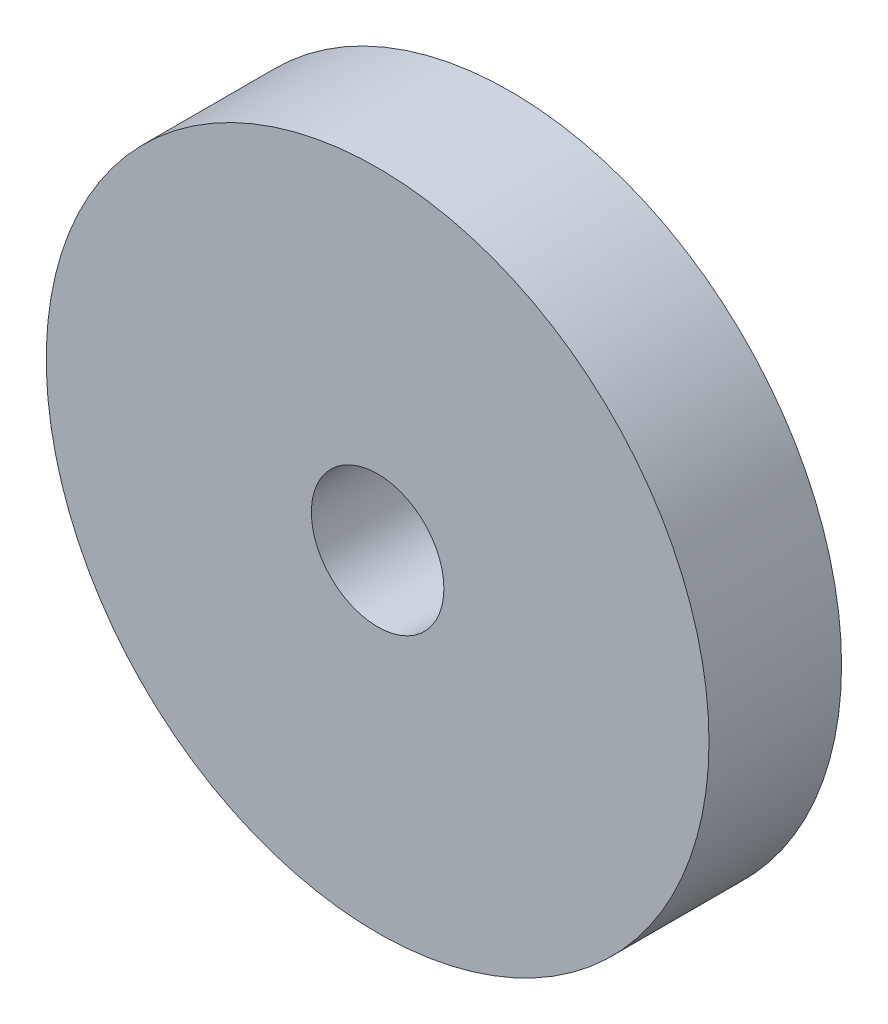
ISO-10303-21;
HEADER;
FILE_DESCRIPTION(('STEP AP214'),'2;1');
FILE_NAME('part.step','',(''),(''),'','','');
FILE_SCHEMA(('AUTOMOTIVE_DESIGN { 1 0 10303 214 1 1 1 1 }'));
ENDSEC;
DATA;
#1=APPLICATION_CONTEXT('core data for automotive mechanical design processes');
#2=APPLICATION_PROTOCOL_DEFINITION('international standard','automotive_design',2000,#1);
#3=PRODUCT_CONTEXT('',#1,'mechanical');
#4=PRODUCT('Part','Part','',(#3));
#5=PRODUCT_RELATED_PRODUCT_CATEGORY('part','',(#4));
#6=PRODUCT_DEFINITION_FORMATION('','',#4);
#7=PRODUCT_DEFINITION_CONTEXT('part definition',#1,'design');
#8=PRODUCT_DEFINITION('design','',#6,#7);
#9=PRODUCT_DEFINITION_SHAPE('','',#8);
#10=(LENGTH_UNIT() NAMED_UNIT(*) SI_UNIT(.MILLI.,.METRE.));
#11=(NAMED_UNIT(*) PLANE_ANGLE_UNIT() SI_UNIT($,.RADIAN.));
#12=(NAMED_UNIT(*) SI_UNIT($,.STERADIAN.) SOLID_ANGLE_UNIT());
#13=UNCERTAINTY_MEASURE_WITH_UNIT(LENGTH_MEASURE(1.E-05),#10,'distance_accuracy_value','');
#14=(GEOMETRIC_REPRESENTATION_CONTEXT(3) GLOBAL_UNCERTAINTY_ASSIGNED_CONTEXT((#13)) GLOBAL_UNIT_ASSIGNED_CONTEXT((#10,
#11,#12)) REPRESENTATION_CONTEXT('',''));
#15=CARTESIAN_POINT('',(0.,0.,0.));
#16=DIRECTION('',(0.,0.,1.));
#17=DIRECTION('',(1.,0.,0.));
#18=AXIS2_PLACEMENT_3D('',#15,#16,#17);
#19=CARTESIAN_POINT('',(0.,0.,6.));
#20=DIRECTION('',(0.,0.,1.));
#21=DIRECTION('',(1.,0.,0.));
#22=AXIS2_PLACEMENT_3D('',#19,#20,#21);
#23=PLANE('',#22);
#24=CARTESIAN_POINT('',(0.,0.,6.));
#25=DIRECTION('',(0.,0.,1.));
#26=DIRECTION('',(1.,0.,0.));
#27=AXIS2_PLACEMENT_3D('',#24,#25,#26);
#28=CIRCLE('',#27,15.);
#29=CARTESIAN_POINT('',(15.,0.,6.));
#30=VERTEX_POINT('',#29);
#31=EDGE_CURVE('E10',#30,#30,#28,.T.);
#32=ORIENTED_EDGE('',*,*,#31,.T.);
#33=EDGE_LOOP('',(#32));
#34=FACE_BOUND('',#33,.T.);
#35=CARTESIAN_POINT('',(0.,0.,6.));
#36=DIRECTION('',(0.,0.,1.));
#37=DIRECTION('',(1.,0.,0.));
#38=AXIS2_PLACEMENT_3D('',#35,#36,#37);
#39=CIRCLE('',#38,3.);
#40=CARTESIAN_POINT('',(3.,0.,6.));
#41=VERTEX_POINT('',#40);
#42=EDGE_CURVE('E35',#41,#41,#39,.T.);
#43=ORIENTED_EDGE('',*,*,#42,.F.);
#44=EDGE_LOOP('',(#43));
#45=FACE_BOUND('',#44,.T.);
#46=ADVANCED_FACE('F24',(#34,#45),#23,.T.);
#47=CARTESIAN_POINT('',(0.,0.,0.));
#48=DIRECTION('',(0.,0.,1.));
#49=DIRECTION('',(1.,0.,0.));
#50=AXIS2_PLACEMENT_3D('',#47,#48,#49);
#51=PLANE('',#50);
#52=CARTESIAN_POINT('',(0.,0.,0.));
#53=DIRECTION('',(0.,0.,1.));
#54=DIRECTION('',(1.,0.,0.));
#55=AXIS2_PLACEMENT_3D('',#52,#53,#54);
#56=CIRCLE('',#55,15.);
#57=CARTESIAN_POINT('',(15.,0.,0.));
#58=VERTEX_POINT('',#57);
#59=EDGE_CURVE('E31',#58,#58,#56,.T.);
#60=ORIENTED_EDGE('',*,*,#59,.F.);
#61=EDGE_LOOP('',(#60));
#62=FACE_BOUND('',#61,.T.);
#63=CARTESIAN_POINT('',(0.,0.,0.));
#64=DIRECTION('',(0.,0.,1.));
#65=DIRECTION('',(1.,0.,0.));
#66=AXIS2_PLACEMENT_3D('',#63,#64,#65);
#67=CIRCLE('',#66,3.);
#68=CARTESIAN_POINT('',(3.,0.,0.));
#69=VERTEX_POINT('',#68);
#70=EDGE_CURVE('E39',#69,#69,#67,.T.);
#71=ORIENTED_EDGE('',*,*,#70,.T.);
#72=EDGE_LOOP('',(#71));
#73=FACE_BOUND('',#72,.T.);
#74=ADVANCED_FACE('F45',(#62,#73),#51,.F.);
#75=CARTESIAN_POINT('',(0.,0.,6.));
#76=DIRECTION('',(0.,0.,-1.));
#77=DIRECTION('',(-1.,0.,0.));
#78=AXIS2_PLACEMENT_3D('',#75,#76,#77);
#79=CYLINDRICAL_SURFACE('',#78,15.);
#80=ORIENTED_EDGE('',*,*,#31,.F.);
#81=EDGE_LOOP('',(#80));
#82=FACE_BOUND('',#81,.T.);
#83=ORIENTED_EDGE('',*,*,#59,.T.);
#84=EDGE_LOOP('',(#83));
#85=FACE_BOUND('',#84,.T.);
#86=ADVANCED_FACE('F26',(#82,#85),#79,.T.);
#87=CARTESIAN_POINT('',(0.,0.,6.));
#88=DIRECTION('',(0.,0.,-1.));
#89=DIRECTION('',(-1.,0.,0.));
#90=AXIS2_PLACEMENT_3D('',#87,#88,#89);
#91=CYLINDRICAL_SURFACE('',#90,3.);
#92=ORIENTED_EDGE('',*,*,#42,.T.);
#93=EDGE_LOOP('',(#92));
#94=FACE_BOUND('',#93,.T.);
#95=ORIENTED_EDGE('',*,*,#70,.F.);
#96=EDGE_LOOP('',(#95));
#97=FACE_BOUND('',#96,.T.);
#98=ADVANCED_FACE('F47',(#94,#97),#91,.F.);
#99=CLOSED_SHELL('',(#46,#74,#86,#98));
#100=MANIFOLD_SOLID_BREP('B2',#99);
#101=ADVANCED_BREP_SHAPE_REPRESENTATION('',(#18,#100),#14);
#102=SHAPE_DEFINITION_REPRESENTATION(#9,#101);
ENDSEC;
END-ISO-10303-21;
